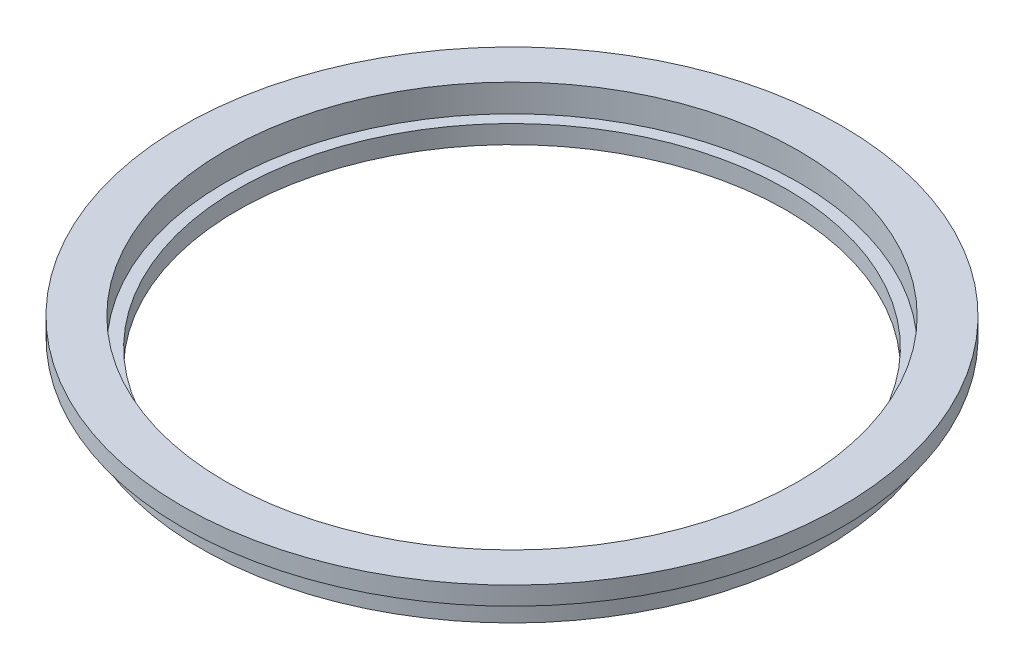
from build123d import *

# Parameters (mm, degrees)
SKETCH1_R           = 18
BOSS_EXTRUDE1_DEPTH = 1.25
SKETCH2_R           = 15.65
CUT_EXTRUDE1_DEPTH  = 1.5
CUT_EXTRUDE2_REACH  = 27.5
SKETCH4_R           = 15
CUT_EXTRUDE3_START  = -1.5
SKETCH5_R           = 18
SKETCH5_R_2         = 17
CUT_EXTRUDE3_DEPTH  = 1.5


with BuildPart() as part:
    # Sketch1 → Boss-Extrude1 (new, symmetric)
    with BuildSketch(Plane(origin=(0, 0, 0), x_dir=(1, 0, 0), z_dir=(0, 1, 0))):
        with Locations(Location((0, 0, 0), (0, 0, 270))):
            Circle(SKETCH1_R)
    extrude(amount=BOSS_EXTRUDE1_DEPTH, both=True)

    # Sketch2 → Cut-Extrude1 (cut)
    with BuildSketch(Plane(origin=(0, 1.25, 0), x_dir=(1, 0, 0), z_dir=(0, 1, 0))):
        with Locations(Location((0, 0, 0), (0, 0, 270))):
            Circle(SKETCH2_R)
    extrude(amount=-CUT_EXTRUDE1_DEPTH, mode=Mode.SUBTRACT)

    # Sketch4 → Cut-Extrude2 (cut, up to next)
    with BuildSketch(Plane(origin=(0, -0.25, 0), x_dir=(1, 0, 0), z_dir=(0, 1, 0)), mode=Mode.PRIVATE) as cut_extrude2_sk1:
        with Locations(Location((0, 0, 0), (0, 0, 270))):
            Circle(SKETCH4_R)
    cut_extrude2_tool1 = extrude(cut_extrude2_sk1.sketch, amount=-CUT_EXTRUDE2_REACH, mode=Mode.PRIVATE) & part.part
    add(cut_extrude2_tool1.solids().sort_by_distance((0, -0.25, 0))[0], mode=Mode.SUBTRACT)

    # Sketch5 → Cut-Extrude3 (cut)
    with BuildSketch(Plane.XZ.offset(1.25).offset(CUT_EXTRUDE3_START)):
        with Locations(Location((0, 0, 0), (0, 0, 270))):
            Circle(SKETCH5_R)
        with Locations(Location((0, 0, 0), (0, 0, 270))):
            Circle(SKETCH5_R_2, mode=Mode.SUBTRACT)
    extrude(amount=CUT_EXTRUDE3_DEPTH, mode=Mode.SUBTRACT)


solid = part.part
